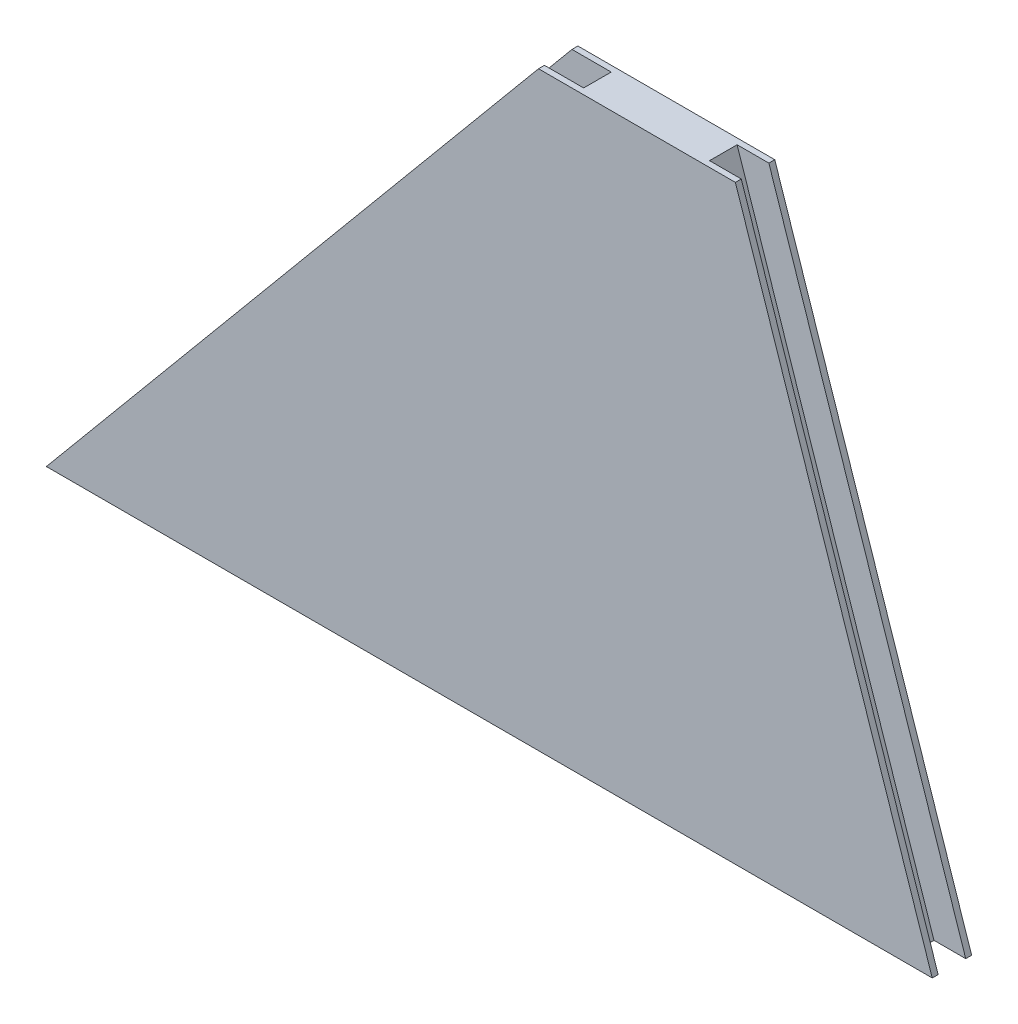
ISO-10303-21;
HEADER;
FILE_DESCRIPTION(('STEP AP214'),'2;1');
FILE_NAME('part.step','',(''),(''),'','','');
FILE_SCHEMA(('AUTOMOTIVE_DESIGN { 1 0 10303 214 1 1 1 1 }'));
ENDSEC;
DATA;
#1=APPLICATION_CONTEXT('core data for automotive mechanical design processes');
#2=APPLICATION_PROTOCOL_DEFINITION('international standard','automotive_design',2000,#1);
#3=PRODUCT_CONTEXT('',#1,'mechanical');
#4=PRODUCT('Part','Part','',(#3));
#5=PRODUCT_RELATED_PRODUCT_CATEGORY('part','',(#4));
#6=PRODUCT_DEFINITION_FORMATION('','',#4);
#7=PRODUCT_DEFINITION_CONTEXT('part definition',#1,'design');
#8=PRODUCT_DEFINITION('design','',#6,#7);
#9=PRODUCT_DEFINITION_SHAPE('','',#8);
#10=(LENGTH_UNIT() NAMED_UNIT(*) SI_UNIT(.MILLI.,.METRE.));
#11=(NAMED_UNIT(*) PLANE_ANGLE_UNIT() SI_UNIT($,.RADIAN.));
#12=(NAMED_UNIT(*) SI_UNIT($,.STERADIAN.) SOLID_ANGLE_UNIT());
#13=UNCERTAINTY_MEASURE_WITH_UNIT(LENGTH_MEASURE(1.E-05),#10,'distance_accuracy_value','');
#14=(GEOMETRIC_REPRESENTATION_CONTEXT(3) GLOBAL_UNCERTAINTY_ASSIGNED_CONTEXT((#13)) GLOBAL_UNIT_ASSIGNED_CONTEXT((#10,
#11,#12)) REPRESENTATION_CONTEXT('',''));
#15=CARTESIAN_POINT('',(0.,0.,0.));
#16=DIRECTION('',(0.,0.,1.));
#17=DIRECTION('',(1.,0.,0.));
#18=AXIS2_PLACEMENT_3D('',#15,#16,#17);
#19=CARTESIAN_POINT('',(18.438515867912,111.154032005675,5.08));
#20=DIRECTION('',(0.768221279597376,-0.64018439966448,0.));
#21=DIRECTION('',(0.64018439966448,0.768221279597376,0.));
#22=AXIS2_PLACEMENT_3D('',#19,#20,#21);
#23=PLANE('',#22);
#24=DIRECTION('',(0.,0.,-1.));
#25=VECTOR('',#24,1.);
#26=CARTESIAN_POINT('',(18.438515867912,111.154032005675,5.08));
#27=LINE('',#26,#25);
#28=CARTESIAN_POINT('',(18.438515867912,111.154032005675,0.762000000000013));
#29=VERTEX_POINT('',#28);
#30=CARTESIAN_POINT('',(18.438515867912,111.154032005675,0.));
#31=VERTEX_POINT('',#30);
#32=EDGE_CURVE('E134',#29,#31,#27,.T.);
#33=ORIENTED_EDGE('',*,*,#32,.F.);
#34=DIRECTION('',(-0.64018439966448,-0.768221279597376,0.));
#35=VECTOR('',#34,1.);
#36=CARTESIAN_POINT('',(95.8857931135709,204.090764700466,0.762000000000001));
#37=LINE('',#36,#35);
#38=CARTESIAN_POINT('',(81.938515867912,187.354032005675,0.762000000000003));
#39=VERTEX_POINT('',#38);
#40=EDGE_CURVE('E122',#39,#29,#37,.T.);
#41=ORIENTED_EDGE('',*,*,#40,.F.);
#42=DIRECTION('',(0.,0.,-1.));
#43=VECTOR('',#42,1.);
#44=CARTESIAN_POINT('',(81.938515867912,187.354032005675,5.08));
#45=LINE('',#44,#43);
#46=CARTESIAN_POINT('',(81.938515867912,187.354032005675,0.));
#47=VERTEX_POINT('',#46);
#48=EDGE_CURVE('E132',#39,#47,#45,.T.);
#49=ORIENTED_EDGE('',*,*,#48,.T.);
#50=DIRECTION('',(-0.64018439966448,-0.768221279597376,0.));
#51=VECTOR('',#50,1.);
#52=CARTESIAN_POINT('',(18.438515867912,111.154032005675,0.));
#53=LINE('',#52,#51);
#54=EDGE_CURVE('E199',#47,#31,#53,.T.);
#55=ORIENTED_EDGE('',*,*,#54,.T.);
#56=EDGE_LOOP('',(#33,#41,#49,#55));
#57=FACE_BOUND('',#56,.T.);
#58=ADVANCED_FACE('F30',(#57),#23,.F.);
#59=CARTESIAN_POINT('',(132.738515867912,111.154032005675,5.08));
#60=DIRECTION('',(-0.948683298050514,-0.316227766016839,0.));
#61=DIRECTION('',(0.316227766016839,-0.948683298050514,0.));
#62=AXIS2_PLACEMENT_3D('',#59,#60,#61);
#63=PLANE('',#62);
#64=DIRECTION('',(0.,0.,-1.));
#65=VECTOR('',#64,1.);
#66=CARTESIAN_POINT('',(107.338515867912,187.354032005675,5.08));
#67=LINE('',#66,#65);
#68=CARTESIAN_POINT('',(107.338515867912,187.354032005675,0.762000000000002));
#69=VERTEX_POINT('',#68);
#70=CARTESIAN_POINT('',(107.338515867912,187.354032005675,0.));
#71=VERTEX_POINT('',#70);
#72=EDGE_CURVE('E216',#69,#71,#67,.T.);
#73=ORIENTED_EDGE('',*,*,#72,.F.);
#74=DIRECTION('',(0.316227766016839,-0.948683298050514,0.));
#75=VECTOR('',#74,1.);
#76=CARTESIAN_POINT('',(132.738515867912,111.154032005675,0.761999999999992));
#77=LINE('',#76,#75);
#78=CARTESIAN_POINT('',(132.738515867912,111.154032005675,0.761999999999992));
#79=VERTEX_POINT('',#78);
#80=EDGE_CURVE('E150',#69,#79,#77,.T.);
#81=ORIENTED_EDGE('',*,*,#80,.T.);
#82=DIRECTION('',(0.,0.,-1.));
#83=VECTOR('',#82,1.);
#84=CARTESIAN_POINT('',(132.738515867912,111.154032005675,5.08));
#85=LINE('',#84,#83);
#86=CARTESIAN_POINT('',(132.738515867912,111.154032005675,0.));
#87=VERTEX_POINT('',#86);
#88=EDGE_CURVE('E219',#79,#87,#85,.T.);
#89=ORIENTED_EDGE('',*,*,#88,.T.);
#90=DIRECTION('',(-0.316227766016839,0.948683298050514,0.));
#91=VECTOR('',#90,1.);
#92=CARTESIAN_POINT('',(132.738515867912,111.154032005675,0.));
#93=LINE('',#92,#91);
#94=EDGE_CURVE('E204',#87,#71,#93,.T.);
#95=ORIENTED_EDGE('',*,*,#94,.T.);
#96=EDGE_LOOP('',(#73,#81,#89,#95));
#97=FACE_BOUND('',#96,.T.);
#98=ADVANCED_FACE('F228',(#97),#63,.F.);
#99=CARTESIAN_POINT('',(81.938515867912,187.354032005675,5.08));
#100=DIRECTION('',(0.,-1.,0.));
#101=DIRECTION('',(0.,0.,-1.));
#102=AXIS2_PLACEMENT_3D('',#99,#100,#101);
#103=PLANE('',#102);
#104=ORIENTED_EDGE('',*,*,#48,.F.);
#105=DIRECTION('',(1.,0.,0.));
#106=VECTOR('',#105,1.);
#107=CARTESIAN_POINT('',(81.938515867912,187.354032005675,0.762000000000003));
#108=LINE('',#107,#106);
#109=CARTESIAN_POINT('',(86.9972145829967,187.354032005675,0.762000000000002));
#110=VERTEX_POINT('',#109);
#111=EDGE_CURVE('E119',#39,#110,#108,.T.);
#112=ORIENTED_EDGE('',*,*,#111,.T.);
#113=DIRECTION('',(0.,0.,-1.));
#114=VECTOR('',#113,1.);
#115=CARTESIAN_POINT('',(86.9972145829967,187.354032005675,5.08));
#116=LINE('',#115,#114);
#117=CARTESIAN_POINT('',(86.9972145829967,187.354032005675,4.318));
#118=VERTEX_POINT('',#117);
#119=EDGE_CURVE('E177',#118,#110,#116,.T.);
#120=ORIENTED_EDGE('',*,*,#119,.F.);
#121=DIRECTION('',(-1.,0.,0.));
#122=VECTOR('',#121,1.);
#123=CARTESIAN_POINT('',(81.938515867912,187.354032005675,4.318));
#124=LINE('',#123,#122);
#125=CARTESIAN_POINT('',(81.938515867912,187.354032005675,4.318));
#126=VERTEX_POINT('',#125);
#127=EDGE_CURVE('E127',#118,#126,#124,.T.);
#128=ORIENTED_EDGE('',*,*,#127,.T.);
#129=CARTESIAN_POINT('',(81.938515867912,187.354032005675,5.08));
#130=VERTEX_POINT('',#129);
#131=EDGE_CURVE('E140',#130,#126,#45,.T.);
#132=ORIENTED_EDGE('',*,*,#131,.F.);
#133=DIRECTION('',(-1.,0.,0.));
#134=VECTOR('',#133,1.);
#135=CARTESIAN_POINT('',(81.938515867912,187.354032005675,5.08));
#136=LINE('',#135,#134);
#137=CARTESIAN_POINT('',(107.338515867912,187.354032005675,5.08));
#138=VERTEX_POINT('',#137);
#139=EDGE_CURVE('E207',#138,#130,#136,.T.);
#140=ORIENTED_EDGE('',*,*,#139,.F.);
#141=CARTESIAN_POINT('',(107.338515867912,187.354032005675,4.318));
#142=VERTEX_POINT('',#141);
#143=EDGE_CURVE('E217',#138,#142,#67,.T.);
#144=ORIENTED_EDGE('',*,*,#143,.T.);
#145=DIRECTION('',(-1.,0.,0.));
#146=VECTOR('',#145,1.);
#147=CARTESIAN_POINT('',(81.938515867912,187.354032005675,4.318));
#148=LINE('',#147,#146);
#149=CARTESIAN_POINT('',(103.24210138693,187.354032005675,4.318));
#150=VERTEX_POINT('',#149);
#151=EDGE_CURVE('E53',#142,#150,#148,.T.);
#152=ORIENTED_EDGE('',*,*,#151,.T.);
#153=DIRECTION('',(0.,0.,-1.));
#154=VECTOR('',#153,1.);
#155=CARTESIAN_POINT('',(103.24210138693,187.354032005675,5.08));
#156=LINE('',#155,#154);
#157=CARTESIAN_POINT('',(103.24210138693,187.354032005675,0.762000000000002));
#158=VERTEX_POINT('',#157);
#159=EDGE_CURVE('E195',#150,#158,#156,.T.);
#160=ORIENTED_EDGE('',*,*,#159,.T.);
#161=DIRECTION('',(1.,0.,0.));
#162=VECTOR('',#161,1.);
#163=CARTESIAN_POINT('',(81.938515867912,187.354032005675,0.762000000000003));
#164=LINE('',#163,#162);
#165=EDGE_CURVE('E192',#158,#69,#164,.T.);
#166=ORIENTED_EDGE('',*,*,#165,.T.);
#167=ORIENTED_EDGE('',*,*,#72,.T.);
#168=DIRECTION('',(-1.,0.,0.));
#169=VECTOR('',#168,1.);
#170=CARTESIAN_POINT('',(81.938515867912,187.354032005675,0.));
#171=LINE('',#170,#169);
#172=EDGE_CURVE('E139',#71,#47,#171,.T.);
#173=ORIENTED_EDGE('',*,*,#172,.T.);
#174=EDGE_LOOP('',(#104,#112,#120,#128,#132,#140,#144,#152,#160,#166,#167,#173));
#175=FACE_BOUND('',#174,.T.);
#176=ADVANCED_FACE('F32',(#175),#103,.F.);
#177=ORIENTED_EDGE('',*,*,#131,.T.);
#178=DIRECTION('',(0.64018439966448,0.768221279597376,0.));
#179=VECTOR('',#178,1.);
#180=CARTESIAN_POINT('',(95.8857931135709,204.090764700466,4.318));
#181=LINE('',#180,#179);
#182=CARTESIAN_POINT('',(18.438515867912,111.154032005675,4.31800000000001));
#183=VERTEX_POINT('',#182);
#184=EDGE_CURVE('E135',#183,#126,#181,.T.);
#185=ORIENTED_EDGE('',*,*,#184,.F.);
#186=CARTESIAN_POINT('',(18.438515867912,111.154032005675,5.08));
#187=VERTEX_POINT('',#186);
#188=EDGE_CURVE('E141',#187,#183,#27,.T.);
#189=ORIENTED_EDGE('',*,*,#188,.F.);
#190=DIRECTION('',(-0.64018439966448,-0.768221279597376,0.));
#191=VECTOR('',#190,1.);
#192=CARTESIAN_POINT('',(18.438515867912,111.154032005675,5.08));
#193=LINE('',#192,#191);
#194=EDGE_CURVE('E210',#130,#187,#193,.T.);
#195=ORIENTED_EDGE('',*,*,#194,.F.);
#196=EDGE_LOOP('',(#177,#185,#189,#195));
#197=FACE_BOUND('',#196,.T.);
#198=ADVANCED_FACE('F171',(#197),#23,.F.);
#199=CARTESIAN_POINT('',(107.338515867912,111.154032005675,5.08));
#200=DIRECTION('',(0.,1.,0.));
#201=DIRECTION('',(-1.,0.,0.));
#202=AXIS2_PLACEMENT_3D('',#199,#200,#201);
#203=PLANE('',#202);
#204=DIRECTION('',(0.,0.,1.));
#205=VECTOR('',#204,1.);
#206=CARTESIAN_POINT('',(23.4972145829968,111.154032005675,5.08));
#207=LINE('',#206,#205);
#208=CARTESIAN_POINT('',(23.4972145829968,111.154032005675,0.762000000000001));
#209=VERTEX_POINT('',#208);
#210=CARTESIAN_POINT('',(23.4972145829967,111.154032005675,4.31800000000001));
#211=VERTEX_POINT('',#210);
#212=EDGE_CURVE('E156',#209,#211,#207,.T.);
#213=ORIENTED_EDGE('',*,*,#212,.F.);
#214=DIRECTION('',(-1.,0.,0.));
#215=VECTOR('',#214,1.);
#216=CARTESIAN_POINT('',(107.338515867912,111.154032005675,0.762000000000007));
#217=LINE('',#216,#215);
#218=EDGE_CURVE('E11',#209,#29,#217,.T.);
#219=ORIENTED_EDGE('',*,*,#218,.T.);
#220=ORIENTED_EDGE('',*,*,#32,.T.);
#221=DIRECTION('',(1.,0.,0.));
#222=VECTOR('',#221,1.);
#223=CARTESIAN_POINT('',(107.338515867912,111.154032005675,0.));
#224=LINE('',#223,#222);
#225=EDGE_CURVE('E201',#31,#87,#224,.T.);
#226=ORIENTED_EDGE('',*,*,#225,.T.);
#227=ORIENTED_EDGE('',*,*,#88,.F.);
#228=DIRECTION('',(-1.,0.,0.));
#229=VECTOR('',#228,1.);
#230=CARTESIAN_POINT('',(107.338515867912,111.154032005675,0.761999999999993));
#231=LINE('',#230,#229);
#232=CARTESIAN_POINT('',(128.64210138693,111.154032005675,0.761999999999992));
#233=VERTEX_POINT('',#232);
#234=EDGE_CURVE('E189',#79,#233,#231,.T.);
#235=ORIENTED_EDGE('',*,*,#234,.T.);
#236=DIRECTION('',(0.,0.,1.));
#237=VECTOR('',#236,1.);
#238=CARTESIAN_POINT('',(128.64210138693,111.154032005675,5.08));
#239=LINE('',#238,#237);
#240=CARTESIAN_POINT('',(128.64210138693,111.154032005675,4.31799999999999));
#241=VERTEX_POINT('',#240);
#242=EDGE_CURVE('E153',#233,#241,#239,.T.);
#243=ORIENTED_EDGE('',*,*,#242,.T.);
#244=DIRECTION('',(1.,0.,0.));
#245=VECTOR('',#244,1.);
#246=CARTESIAN_POINT('',(107.338515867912,111.154032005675,4.31799999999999));
#247=LINE('',#246,#245);
#248=CARTESIAN_POINT('',(132.738515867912,111.154032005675,4.31799999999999));
#249=VERTEX_POINT('',#248);
#250=EDGE_CURVE('E185',#241,#249,#247,.T.);
#251=ORIENTED_EDGE('',*,*,#250,.T.);
#252=CARTESIAN_POINT('',(132.738515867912,111.154032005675,5.08));
#253=VERTEX_POINT('',#252);
#254=EDGE_CURVE('E220',#253,#249,#85,.T.);
#255=ORIENTED_EDGE('',*,*,#254,.F.);
#256=DIRECTION('',(1.,0.,0.));
#257=VECTOR('',#256,1.);
#258=CARTESIAN_POINT('',(107.338515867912,111.154032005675,5.08));
#259=LINE('',#258,#257);
#260=EDGE_CURVE('E212',#187,#253,#259,.T.);
#261=ORIENTED_EDGE('',*,*,#260,.F.);
#262=ORIENTED_EDGE('',*,*,#188,.T.);
#263=DIRECTION('',(1.,0.,0.));
#264=VECTOR('',#263,1.);
#265=CARTESIAN_POINT('',(107.338515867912,111.154032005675,4.31800000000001));
#266=LINE('',#265,#264);
#267=EDGE_CURVE('E38',#183,#211,#266,.T.);
#268=ORIENTED_EDGE('',*,*,#267,.T.);
#269=EDGE_LOOP('',(#213,#219,#220,#226,#227,#235,#243,#251,#255,#261,#262,#268));
#270=FACE_BOUND('',#269,.T.);
#271=ADVANCED_FACE('F160',(#270),#203,.F.);
#272=ORIENTED_EDGE('',*,*,#254,.T.);
#273=DIRECTION('',(-0.316227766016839,0.948683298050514,0.));
#274=VECTOR('',#273,1.);
#275=CARTESIAN_POINT('',(132.738515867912,111.154032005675,4.31799999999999));
#276=LINE('',#275,#274);
#277=EDGE_CURVE('E144',#249,#142,#276,.T.);
#278=ORIENTED_EDGE('',*,*,#277,.T.);
#279=ORIENTED_EDGE('',*,*,#143,.F.);
#280=DIRECTION('',(-0.316227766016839,0.948683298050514,0.));
#281=VECTOR('',#280,1.);
#282=CARTESIAN_POINT('',(132.738515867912,111.154032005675,5.08));
#283=LINE('',#282,#281);
#284=EDGE_CURVE('E214',#253,#138,#283,.T.);
#285=ORIENTED_EDGE('',*,*,#284,.F.);
#286=EDGE_LOOP('',(#272,#278,#279,#285));
#287=FACE_BOUND('',#286,.T.);
#288=ADVANCED_FACE('F244',(#287),#63,.F.);
#289=CARTESIAN_POINT('',(107.338515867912,187.354032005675,5.08));
#290=DIRECTION('',(0.,0.,1.));
#291=DIRECTION('',(1.,0.,0.));
#292=AXIS2_PLACEMENT_3D('',#289,#290,#291);
#293=PLANE('',#292);
#294=ORIENTED_EDGE('',*,*,#139,.T.);
#295=ORIENTED_EDGE('',*,*,#194,.T.);
#296=ORIENTED_EDGE('',*,*,#260,.T.);
#297=ORIENTED_EDGE('',*,*,#284,.T.);
#298=EDGE_LOOP('',(#294,#295,#296,#297));
#299=FACE_BOUND('',#298,.T.);
#300=ADVANCED_FACE('F235',(#299),#293,.T.);
#301=CARTESIAN_POINT('',(107.338515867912,187.354032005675,0.));
#302=DIRECTION('',(0.,0.,1.));
#303=DIRECTION('',(1.,0.,0.));
#304=AXIS2_PLACEMENT_3D('',#301,#302,#303);
#305=PLANE('',#304);
#306=ORIENTED_EDGE('',*,*,#172,.F.);
#307=ORIENTED_EDGE('',*,*,#94,.F.);
#308=ORIENTED_EDGE('',*,*,#225,.F.);
#309=ORIENTED_EDGE('',*,*,#54,.F.);
#310=EDGE_LOOP('',(#306,#307,#308,#309));
#311=FACE_BOUND('',#310,.T.);
#312=ADVANCED_FACE('F232',(#311),#305,.F.);
#313=CARTESIAN_POINT('',(129.176546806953,109.550695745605,0.761999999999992));
#314=DIRECTION('',(-0.948683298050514,-0.316227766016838,0.));
#315=DIRECTION('',(0.316227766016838,-0.948683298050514,0.));
#316=AXIS2_PLACEMENT_3D('',#313,#314,#315);
#317=PLANE('',#316);
#318=DIRECTION('',(0.316227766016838,-0.948683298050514,0.));
#319=VECTOR('',#318,1.);
#320=CARTESIAN_POINT('',(102.606781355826,189.259992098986,4.318));
#321=LINE('',#320,#319);
#322=EDGE_CURVE('E182',#150,#241,#321,.T.);
#323=ORIENTED_EDGE('',*,*,#322,.T.);
#324=ORIENTED_EDGE('',*,*,#242,.F.);
#325=DIRECTION('',(-0.316227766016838,0.948683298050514,0.));
#326=VECTOR('',#325,1.);
#327=CARTESIAN_POINT('',(102.606781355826,189.259992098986,0.762000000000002));
#328=LINE('',#327,#326);
#329=EDGE_CURVE('E126',#233,#158,#328,.T.);
#330=ORIENTED_EDGE('',*,*,#329,.T.);
#331=ORIENTED_EDGE('',*,*,#159,.F.);
#332=EDGE_LOOP('',(#323,#324,#330,#331));
#333=FACE_BOUND('',#332,.T.);
#334=ADVANCED_FACE('F234',(#333),#317,.F.);
#335=CARTESIAN_POINT('',(102.606781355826,189.259992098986,0.762000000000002));
#336=DIRECTION('',(0.,0.,-1.));
#337=DIRECTION('',(0.,1.,0.));
#338=AXIS2_PLACEMENT_3D('',#335,#336,#337);
#339=PLANE('',#338);
#340=ORIENTED_EDGE('',*,*,#329,.F.);
#341=ORIENTED_EDGE('',*,*,#234,.F.);
#342=ORIENTED_EDGE('',*,*,#80,.F.);
#343=ORIENTED_EDGE('',*,*,#165,.F.);
#344=EDGE_LOOP('',(#340,#341,#342,#343));
#345=FACE_BOUND('',#344,.T.);
#346=ADVANCED_FACE('F241',(#345),#339,.F.);
#347=CARTESIAN_POINT('',(102.606781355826,189.259992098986,4.318));
#348=DIRECTION('',(0.,0.,1.));
#349=DIRECTION('',(0.,-1.,0.));
#350=AXIS2_PLACEMENT_3D('',#347,#348,#349);
#351=PLANE('',#350);
#352=ORIENTED_EDGE('',*,*,#277,.F.);
#353=ORIENTED_EDGE('',*,*,#250,.F.);
#354=ORIENTED_EDGE('',*,*,#322,.F.);
#355=ORIENTED_EDGE('',*,*,#151,.F.);
#356=EDGE_LOOP('',(#352,#353,#354,#355));
#357=FACE_BOUND('',#356,.T.);
#358=ADVANCED_FACE('F292',(#357),#351,.F.);
#359=CARTESIAN_POINT('',(98.8712546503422,201.602880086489,0.762000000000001));
#360=DIRECTION('',(0.,0.,-1.));
#361=DIRECTION('',(0.,1.,0.));
#362=AXIS2_PLACEMENT_3D('',#359,#360,#361);
#363=PLANE('',#362);
#364=ORIENTED_EDGE('',*,*,#40,.T.);
#365=ORIENTED_EDGE('',*,*,#218,.F.);
#366=DIRECTION('',(-0.64018439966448,-0.768221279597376,0.));
#367=VECTOR('',#366,1.);
#368=CARTESIAN_POINT('',(98.8712546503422,201.602880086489,0.762000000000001));
#369=LINE('',#368,#367);
#370=EDGE_CURVE('E45',#110,#209,#369,.T.);
#371=ORIENTED_EDGE('',*,*,#370,.F.);
#372=ORIENTED_EDGE('',*,*,#111,.F.);
#373=EDGE_LOOP('',(#364,#365,#371,#372));
#374=FACE_BOUND('',#373,.T.);
#375=ADVANCED_FACE('F121',(#374),#363,.F.);
#376=CARTESIAN_POINT('',(98.8712546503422,201.602880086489,4.318));
#377=DIRECTION('',(0.,0.,1.));
#378=DIRECTION('',(0.,-1.,0.));
#379=AXIS2_PLACEMENT_3D('',#376,#377,#378);
#380=PLANE('',#379);
#381=DIRECTION('',(0.64018439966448,0.768221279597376,0.));
#382=VECTOR('',#381,1.);
#383=CARTESIAN_POINT('',(98.8712546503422,201.602880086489,4.318));
#384=LINE('',#383,#382);
#385=EDGE_CURVE('E169',#211,#118,#384,.T.);
#386=ORIENTED_EDGE('',*,*,#385,.F.);
#387=ORIENTED_EDGE('',*,*,#267,.F.);
#388=ORIENTED_EDGE('',*,*,#184,.T.);
#389=ORIENTED_EDGE('',*,*,#127,.F.);
#390=EDGE_LOOP('',(#386,#387,#388,#389));
#391=FACE_BOUND('',#390,.T.);
#392=ADVANCED_FACE('F166',(#391),#380,.F.);
#393=CARTESIAN_POINT('',(20.1791991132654,107.172413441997,0.762000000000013));
#394=DIRECTION('',(-0.768221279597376,0.64018439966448,0.));
#395=DIRECTION('',(-0.64018439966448,-0.768221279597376,0.));
#396=AXIS2_PLACEMENT_3D('',#393,#394,#395);
#397=PLANE('',#396);
#398=ORIENTED_EDGE('',*,*,#119,.T.);
#399=ORIENTED_EDGE('',*,*,#370,.T.);
#400=ORIENTED_EDGE('',*,*,#212,.T.);
#401=ORIENTED_EDGE('',*,*,#385,.T.);
#402=EDGE_LOOP('',(#398,#399,#400,#401));
#403=FACE_BOUND('',#402,.T.);
#404=ADVANCED_FACE('F322',(#403),#397,.T.);
#405=CLOSED_SHELL('',(#58,#98,#176,#198,#271,#288,#300,#312,#334,#346,#358,#375,#392,#404));
#406=MANIFOLD_SOLID_BREP('B2',#405);
#407=ADVANCED_BREP_SHAPE_REPRESENTATION('',(#18,#406),#14);
#408=SHAPE_DEFINITION_REPRESENTATION(#9,#407);
ENDSEC;
END-ISO-10303-21;
